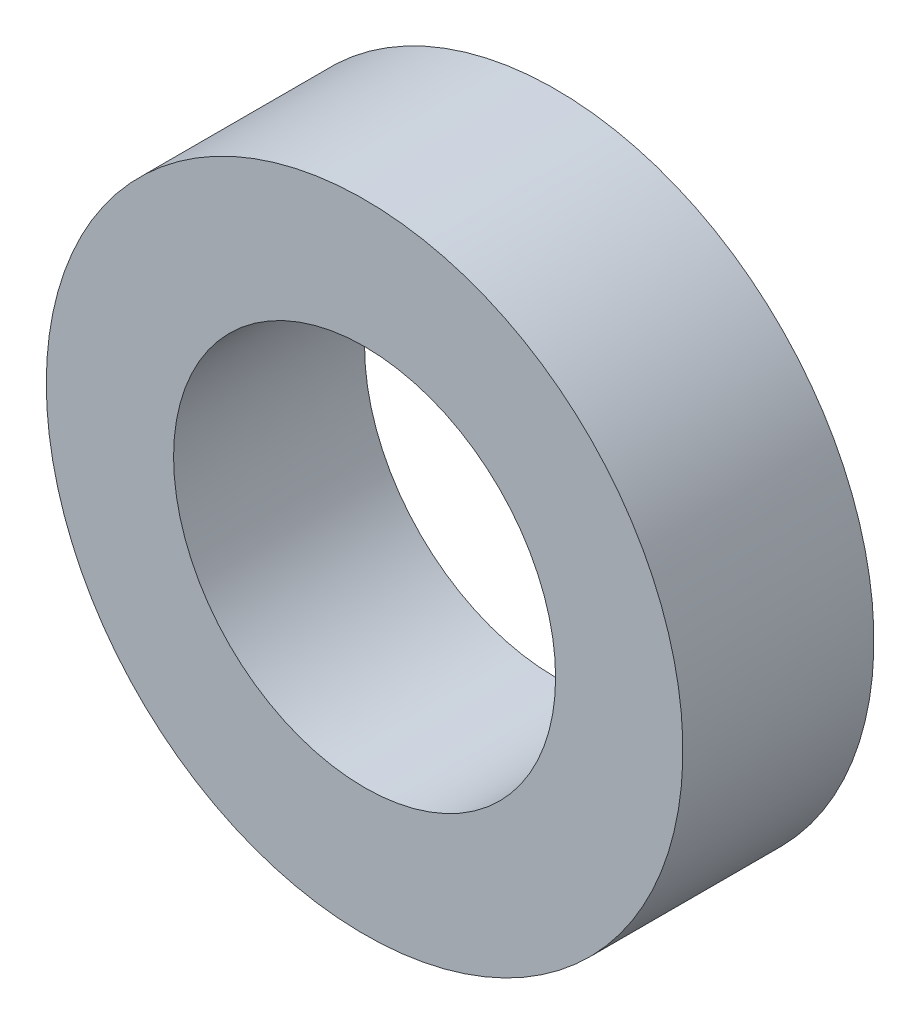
ISO-10303-21;
HEADER;
FILE_DESCRIPTION(('STEP AP214'),'2;1');
FILE_NAME('part.step','',(''),(''),'','','');
FILE_SCHEMA(('AUTOMOTIVE_DESIGN { 1 0 10303 214 1 1 1 1 }'));
ENDSEC;
DATA;
#1=APPLICATION_CONTEXT('core data for automotive mechanical design processes');
#2=APPLICATION_PROTOCOL_DEFINITION('international standard','automotive_design',2000,#1);
#3=PRODUCT_CONTEXT('',#1,'mechanical');
#4=PRODUCT('Part','Part','',(#3));
#5=PRODUCT_RELATED_PRODUCT_CATEGORY('part','',(#4));
#6=PRODUCT_DEFINITION_FORMATION('','',#4);
#7=PRODUCT_DEFINITION_CONTEXT('part definition',#1,'design');
#8=PRODUCT_DEFINITION('design','',#6,#7);
#9=PRODUCT_DEFINITION_SHAPE('','',#8);
#10=(LENGTH_UNIT() NAMED_UNIT(*) SI_UNIT(.MILLI.,.METRE.));
#11=(NAMED_UNIT(*) PLANE_ANGLE_UNIT() SI_UNIT($,.RADIAN.));
#12=(NAMED_UNIT(*) SI_UNIT($,.STERADIAN.) SOLID_ANGLE_UNIT());
#13=UNCERTAINTY_MEASURE_WITH_UNIT(LENGTH_MEASURE(1.E-05),#10,'distance_accuracy_value','');
#14=(GEOMETRIC_REPRESENTATION_CONTEXT(3) GLOBAL_UNCERTAINTY_ASSIGNED_CONTEXT((#13)) GLOBAL_UNIT_ASSIGNED_CONTEXT((#10,
#11,#12)) REPRESENTATION_CONTEXT('',''));
#15=CARTESIAN_POINT('',(0.,0.,0.));
#16=DIRECTION('',(0.,0.,1.));
#17=DIRECTION('',(1.,0.,0.));
#18=AXIS2_PLACEMENT_3D('',#15,#16,#17);
#19=CARTESIAN_POINT('',(0.,0.,2.99973999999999));
#20=DIRECTION('',(0.,0.,0.999999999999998));
#21=DIRECTION('',(0.999999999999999,0.,0.));
#22=AXIS2_PLACEMENT_3D('',#19,#20,#21);
#23=PLANE('',#22);
#24=CARTESIAN_POINT('',(0.,0.,2.99973999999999));
#25=DIRECTION('',(0.,0.,0.999999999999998));
#26=DIRECTION('',(0.999999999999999,0.,0.));
#27=AXIS2_PLACEMENT_3D('',#24,#25,#26);
#28=CIRCLE('',#27,4.99872);
#29=CARTESIAN_POINT('',(-4.99872,0.,2.99973999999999));
#30=VERTEX_POINT('',#29);
#31=EDGE_CURVE('E10',#30,#30,#28,.T.);
#32=ORIENTED_EDGE('',*,*,#31,.T.);
#33=EDGE_LOOP('',(#32));
#34=FACE_BOUND('',#33,.T.);
#35=CARTESIAN_POINT('',(0.,0.,2.99973999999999));
#36=DIRECTION('',(0.,0.,0.999999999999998));
#37=DIRECTION('',(0.999999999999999,0.,0.));
#38=AXIS2_PLACEMENT_3D('',#35,#36,#37);
#39=CIRCLE('',#38,2.99974);
#40=CARTESIAN_POINT('',(-2.99974,0.,2.99973999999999));
#41=VERTEX_POINT('',#40);
#42=EDGE_CURVE('E41',#41,#41,#39,.T.);
#43=ORIENTED_EDGE('',*,*,#42,.F.);
#44=EDGE_LOOP('',(#43));
#45=FACE_BOUND('',#44,.T.);
#46=ADVANCED_FACE('F30',(#34,#45),#23,.T.);
#47=CARTESIAN_POINT('',(0.,0.,0.));
#48=DIRECTION('',(0.,0.,0.999999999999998));
#49=DIRECTION('',(0.999999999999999,0.,0.));
#50=AXIS2_PLACEMENT_3D('',#47,#48,#49);
#51=PLANE('',#50);
#52=CARTESIAN_POINT('',(0.,0.,0.));
#53=DIRECTION('',(0.,0.,0.999999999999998));
#54=DIRECTION('',(0.999999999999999,0.,0.));
#55=AXIS2_PLACEMENT_3D('',#52,#53,#54);
#56=CIRCLE('',#55,4.99872);
#57=CARTESIAN_POINT('',(-4.99872,0.,0.));
#58=VERTEX_POINT('',#57);
#59=EDGE_CURVE('E34',#58,#58,#56,.T.);
#60=ORIENTED_EDGE('',*,*,#59,.F.);
#61=EDGE_LOOP('',(#60));
#62=FACE_BOUND('',#61,.T.);
#63=CARTESIAN_POINT('',(0.,0.,0.));
#64=DIRECTION('',(0.,0.,0.999999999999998));
#65=DIRECTION('',(0.999999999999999,0.,0.));
#66=AXIS2_PLACEMENT_3D('',#63,#64,#65);
#67=CIRCLE('',#66,2.99974);
#68=CARTESIAN_POINT('',(-2.99974,0.,0.));
#69=VERTEX_POINT('',#68);
#70=EDGE_CURVE('E43',#69,#69,#67,.T.);
#71=ORIENTED_EDGE('',*,*,#70,.T.);
#72=EDGE_LOOP('',(#71));
#73=FACE_BOUND('',#72,.T.);
#74=ADVANCED_FACE('F53',(#62,#73),#51,.F.);
#75=CARTESIAN_POINT('',(0.,0.,2.99973999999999));
#76=DIRECTION('',(0.,0.,-0.999999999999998));
#77=DIRECTION('',(-0.999999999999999,0.,0.));
#78=AXIS2_PLACEMENT_3D('',#75,#76,#77);
#79=CYLINDRICAL_SURFACE('',#78,4.99872);
#80=CARTESIAN_POINT('',(-4.99872,0.,2.99973999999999));
#81=CARTESIAN_POINT('',(-4.99872,0.,2.96849270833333));
#82=CARTESIAN_POINT('',(-4.99872,0.,2.93724541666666));
#83=CARTESIAN_POINT('',(-4.99872,0.,2.87475083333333));
#84=CARTESIAN_POINT('',(-4.99872,0.,2.84350354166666));
#85=CARTESIAN_POINT('',(-4.99872,0.,2.78100895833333));
#86=CARTESIAN_POINT('',(-4.99872,0.,2.74976166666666));
#87=CARTESIAN_POINT('',(-4.99872,0.,2.68726708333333));
#88=CARTESIAN_POINT('',(-4.99872,0.,2.65601979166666));
#89=CARTESIAN_POINT('',(-4.99872,0.,2.59352520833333));
#90=CARTESIAN_POINT('',(-4.99872,0.,2.56227791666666));
#91=CARTESIAN_POINT('',(-4.99872,0.,2.49978333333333));
#92=CARTESIAN_POINT('',(-4.99872,0.,2.46853604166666));
#93=CARTESIAN_POINT('',(-4.99872,0.,2.40604145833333));
#94=CARTESIAN_POINT('',(-4.99872,0.,2.37479416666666));
#95=CARTESIAN_POINT('',(-4.99872,0.,2.31229958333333));
#96=CARTESIAN_POINT('',(-4.99872,0.,2.28105229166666));
#97=CARTESIAN_POINT('',(-4.99872,0.,2.21855770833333));
#98=CARTESIAN_POINT('',(-4.99872,0.,2.18731041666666));
#99=CARTESIAN_POINT('',(-4.99872,0.,2.12481583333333));
#100=CARTESIAN_POINT('',(-4.99872,0.,2.09356854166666));
#101=CARTESIAN_POINT('',(-4.99872,0.,2.03107395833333));
#102=CARTESIAN_POINT('',(-4.99872,0.,1.99982666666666));
#103=CARTESIAN_POINT('',(-4.99872,0.,1.93733208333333));
#104=CARTESIAN_POINT('',(-4.99872,0.,1.90608479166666));
#105=CARTESIAN_POINT('',(-4.99872,0.,1.84359020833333));
#106=CARTESIAN_POINT('',(-4.99872,0.,1.81234291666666));
#107=CARTESIAN_POINT('',(-4.99872,0.,1.74984833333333));
#108=CARTESIAN_POINT('',(-4.99872,0.,1.71860104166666));
#109=CARTESIAN_POINT('',(-4.99872,0.,1.65610645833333));
#110=CARTESIAN_POINT('',(-4.99872,0.,1.62485916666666));
#111=CARTESIAN_POINT('',(-4.99872,0.,1.56236458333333));
#112=CARTESIAN_POINT('',(-4.99872,0.,1.53111729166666));
#113=CARTESIAN_POINT('',(-4.99872,0.,1.46862270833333));
#114=CARTESIAN_POINT('',(-4.99872,0.,1.43737541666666));
#115=CARTESIAN_POINT('',(-4.99872,0.,1.37488083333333));
#116=CARTESIAN_POINT('',(-4.99872,0.,1.34363354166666));
#117=CARTESIAN_POINT('',(-4.99872,0.,1.28113895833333));
#118=CARTESIAN_POINT('',(-4.99872,0.,1.24989166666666));
#119=CARTESIAN_POINT('',(-4.99872,0.,1.18739708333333));
#120=CARTESIAN_POINT('',(-4.99872,0.,1.15614979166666));
#121=CARTESIAN_POINT('',(-4.99872,0.,1.09365520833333));
#122=CARTESIAN_POINT('',(-4.99872,0.,1.06240791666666));
#123=CARTESIAN_POINT('',(-4.99872,0.,0.999913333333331));
#124=CARTESIAN_POINT('',(-4.99872,0.,0.968666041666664));
#125=CARTESIAN_POINT('',(-4.99872,0.,0.906171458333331));
#126=CARTESIAN_POINT('',(-4.99872,0.,0.874924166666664));
#127=CARTESIAN_POINT('',(-4.99872,0.,0.812429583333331));
#128=CARTESIAN_POINT('',(-4.99872,0.,0.781182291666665));
#129=CARTESIAN_POINT('',(-4.99872,0.,0.718687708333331));
#130=CARTESIAN_POINT('',(-4.99872,0.,0.687440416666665));
#131=CARTESIAN_POINT('',(-4.99872,0.,0.624945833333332));
#132=CARTESIAN_POINT('',(-4.99872,0.,0.593698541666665));
#133=CARTESIAN_POINT('',(-4.99872,0.,0.531203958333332));
#134=CARTESIAN_POINT('',(-4.99872,0.,0.499956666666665));
#135=CARTESIAN_POINT('',(-4.99872,0.,0.437462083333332));
#136=CARTESIAN_POINT('',(-4.99872,0.,0.406214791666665));
#137=CARTESIAN_POINT('',(-4.99872,0.,0.343720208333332));
#138=CARTESIAN_POINT('',(-4.99872,0.,0.312472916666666));
#139=CARTESIAN_POINT('',(-4.99872,0.,0.249978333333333));
#140=CARTESIAN_POINT('',(-4.99872,0.,0.218731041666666));
#141=CARTESIAN_POINT('',(-4.99872,0.,0.156236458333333));
#142=CARTESIAN_POINT('',(-4.99872,0.,0.124989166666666));
#143=CARTESIAN_POINT('',(-4.99872,0.,0.0624945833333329));
#144=CARTESIAN_POINT('',(-4.99872,0.,0.0312472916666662));
#145=CARTESIAN_POINT('',(-4.99872,0.,0.));
#146=B_SPLINE_CURVE_WITH_KNOTS('',3,(#80,#81,#82,#83,#84,#85,#86,#87,#88,#89,#90,#91,#92,#93,
#94,#95,#96,#97,#98,#99,#100,#101,#102,#103,#104,#105,#106,#107,#108,#109,#110,#111,#112,#113,
#114,#115,#116,#117,#118,#119,#120,#121,#122,#123,#124,#125,#126,#127,#128,#129,#130,#131,#132,
#133,#134,#135,#136,#137,#138,#139,#140,#141,#142,#143,#144,#145),.UNSPECIFIED.,.F.,.F.,(4,2,2,
2,2,2,2,2,2,2,2,2,2,2,2,2,2,2,2,2,2,2,2,2,2,2,2,2,2,2,2,2,4),(0.,0.0937418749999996,
0.187483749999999,0.281225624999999,0.374967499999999,0.468709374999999,0.562451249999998,
0.656193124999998,0.749934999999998,0.843676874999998,0.937418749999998,1.031160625,1.1249025,
1.218644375,1.31238625,1.406128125,1.49987,1.593611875,1.68735375,1.781095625,1.8748375,
1.968579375,2.06232125,2.15606312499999,2.24980499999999,2.34354687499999,2.43728874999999,
2.53103062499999,2.62477249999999,2.71851437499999,2.81225624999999,2.90599812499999,
2.99973999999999),.UNSPECIFIED.);
#147=EDGE_CURVE('BSEAM32',#30,#58,#146,.T.);
#148=ORIENTED_EDGE('',*,*,#31,.F.);
#149=ORIENTED_EDGE('',*,*,#59,.T.);
#150=ORIENTED_EDGE('',*,*,#147,.T.);
#151=ORIENTED_EDGE('',*,*,#147,.F.);
#152=EDGE_LOOP('',(#148,#150,#149,#151));
#153=FACE_BOUND('',#152,.T.);
#154=ADVANCED_FACE('F32',(#153),#79,.T.);
#155=CARTESIAN_POINT('',(0.,0.,2.99973999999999));
#156=DIRECTION('',(0.,0.,-0.999999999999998));
#157=DIRECTION('',(-0.999999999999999,0.,0.));
#158=AXIS2_PLACEMENT_3D('',#155,#156,#157);
#159=CYLINDRICAL_SURFACE('',#158,2.99974);
#160=CARTESIAN_POINT('',(-2.99974,0.,2.99973999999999));
#161=CARTESIAN_POINT('',(-2.99974,0.,2.96849270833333));
#162=CARTESIAN_POINT('',(-2.99974,0.,2.93724541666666));
#163=CARTESIAN_POINT('',(-2.99974,0.,2.87475083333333));
#164=CARTESIAN_POINT('',(-2.99974,0.,2.84350354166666));
#165=CARTESIAN_POINT('',(-2.99974,0.,2.78100895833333));
#166=CARTESIAN_POINT('',(-2.99974,0.,2.74976166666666));
#167=CARTESIAN_POINT('',(-2.99974,0.,2.68726708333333));
#168=CARTESIAN_POINT('',(-2.99974,0.,2.65601979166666));
#169=CARTESIAN_POINT('',(-2.99974,0.,2.59352520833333));
#170=CARTESIAN_POINT('',(-2.99974,0.,2.56227791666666));
#171=CARTESIAN_POINT('',(-2.99974,0.,2.49978333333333));
#172=CARTESIAN_POINT('',(-2.99974,0.,2.46853604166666));
#173=CARTESIAN_POINT('',(-2.99974,0.,2.40604145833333));
#174=CARTESIAN_POINT('',(-2.99974,0.,2.37479416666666));
#175=CARTESIAN_POINT('',(-2.99974,0.,2.31229958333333));
#176=CARTESIAN_POINT('',(-2.99974,0.,2.28105229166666));
#177=CARTESIAN_POINT('',(-2.99974,0.,2.21855770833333));
#178=CARTESIAN_POINT('',(-2.99974,0.,2.18731041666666));
#179=CARTESIAN_POINT('',(-2.99974,0.,2.12481583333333));
#180=CARTESIAN_POINT('',(-2.99974,0.,2.09356854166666));
#181=CARTESIAN_POINT('',(-2.99974,0.,2.03107395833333));
#182=CARTESIAN_POINT('',(-2.99974,0.,1.99982666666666));
#183=CARTESIAN_POINT('',(-2.99974,0.,1.93733208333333));
#184=CARTESIAN_POINT('',(-2.99974,0.,1.90608479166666));
#185=CARTESIAN_POINT('',(-2.99974,0.,1.84359020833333));
#186=CARTESIAN_POINT('',(-2.99974,0.,1.81234291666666));
#187=CARTESIAN_POINT('',(-2.99974,0.,1.74984833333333));
#188=CARTESIAN_POINT('',(-2.99974,0.,1.71860104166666));
#189=CARTESIAN_POINT('',(-2.99974,0.,1.65610645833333));
#190=CARTESIAN_POINT('',(-2.99974,0.,1.62485916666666));
#191=CARTESIAN_POINT('',(-2.99974,0.,1.56236458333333));
#192=CARTESIAN_POINT('',(-2.99974,0.,1.53111729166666));
#193=CARTESIAN_POINT('',(-2.99974,0.,1.46862270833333));
#194=CARTESIAN_POINT('',(-2.99974,0.,1.43737541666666));
#195=CARTESIAN_POINT('',(-2.99974,0.,1.37488083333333));
#196=CARTESIAN_POINT('',(-2.99974,0.,1.34363354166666));
#197=CARTESIAN_POINT('',(-2.99974,0.,1.28113895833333));
#198=CARTESIAN_POINT('',(-2.99974,0.,1.24989166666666));
#199=CARTESIAN_POINT('',(-2.99974,0.,1.18739708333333));
#200=CARTESIAN_POINT('',(-2.99974,0.,1.15614979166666));
#201=CARTESIAN_POINT('',(-2.99974,0.,1.09365520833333));
#202=CARTESIAN_POINT('',(-2.99974,0.,1.06240791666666));
#203=CARTESIAN_POINT('',(-2.99974,0.,0.999913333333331));
#204=CARTESIAN_POINT('',(-2.99974,0.,0.968666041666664));
#205=CARTESIAN_POINT('',(-2.99974,0.,0.906171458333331));
#206=CARTESIAN_POINT('',(-2.99974,0.,0.874924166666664));
#207=CARTESIAN_POINT('',(-2.99974,0.,0.812429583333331));
#208=CARTESIAN_POINT('',(-2.99974,0.,0.781182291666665));
#209=CARTESIAN_POINT('',(-2.99974,0.,0.718687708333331));
#210=CARTESIAN_POINT('',(-2.99974,0.,0.687440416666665));
#211=CARTESIAN_POINT('',(-2.99974,0.,0.624945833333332));
#212=CARTESIAN_POINT('',(-2.99974,0.,0.593698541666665));
#213=CARTESIAN_POINT('',(-2.99974,0.,0.531203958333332));
#214=CARTESIAN_POINT('',(-2.99974,0.,0.499956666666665));
#215=CARTESIAN_POINT('',(-2.99974,0.,0.437462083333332));
#216=CARTESIAN_POINT('',(-2.99974,0.,0.406214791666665));
#217=CARTESIAN_POINT('',(-2.99974,0.,0.343720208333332));
#218=CARTESIAN_POINT('',(-2.99974,0.,0.312472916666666));
#219=CARTESIAN_POINT('',(-2.99974,0.,0.249978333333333));
#220=CARTESIAN_POINT('',(-2.99974,0.,0.218731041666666));
#221=CARTESIAN_POINT('',(-2.99974,0.,0.156236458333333));
#222=CARTESIAN_POINT('',(-2.99974,0.,0.124989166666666));
#223=CARTESIAN_POINT('',(-2.99974,0.,0.0624945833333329));
#224=CARTESIAN_POINT('',(-2.99974,0.,0.0312472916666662));
#225=CARTESIAN_POINT('',(-2.99974,0.,0.));
#226=B_SPLINE_CURVE_WITH_KNOTS('',3,(#160,#161,#162,#163,#164,#165,#166,#167,#168,#169,#170,
#171,#172,#173,#174,#175,#176,#177,#178,#179,#180,#181,#182,#183,#184,#185,#186,#187,#188,#189,
#190,#191,#192,#193,#194,#195,#196,#197,#198,#199,#200,#201,#202,#203,#204,#205,#206,#207,#208,
#209,#210,#211,#212,#213,#214,#215,#216,#217,#218,#219,#220,#221,#222,#223,#224,#225),
.UNSPECIFIED.,.F.,.F.,(4,2,2,2,2,2,2,2,2,2,2,2,2,2,2,2,2,2,2,2,2,2,2,2,2,2,2,2,2,2,2,2,4),(0.,
0.093741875,0.18748375,0.281225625,0.374967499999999,0.468709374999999,0.562451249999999,
0.656193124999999,0.749934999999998,0.843676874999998,0.937418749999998,1.031160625,1.1249025,
1.218644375,1.31238625,1.406128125,1.49987,1.593611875,1.68735375,1.781095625,1.8748375,
1.968579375,2.06232125,2.156063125,2.24980499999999,2.343546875,2.43728874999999,
2.53103062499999,2.62477249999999,2.71851437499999,2.81225624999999,2.90599812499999,
2.99973999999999),.UNSPECIFIED.);
#227=EDGE_CURVE('BSEAM49',#41,#69,#226,.T.);
#228=ORIENTED_EDGE('',*,*,#42,.T.);
#229=ORIENTED_EDGE('',*,*,#70,.F.);
#230=ORIENTED_EDGE('',*,*,#227,.T.);
#231=ORIENTED_EDGE('',*,*,#227,.F.);
#232=EDGE_LOOP('',(#228,#230,#229,#231));
#233=FACE_BOUND('',#232,.T.);
#234=ADVANCED_FACE('F49',(#233),#159,.F.);
#235=CLOSED_SHELL('',(#46,#74,#154,#234));
#236=MANIFOLD_SOLID_BREP('B2',#235);
#237=ADVANCED_BREP_SHAPE_REPRESENTATION('',(#18,#236),#14);
#238=SHAPE_DEFINITION_REPRESENTATION(#9,#237);
ENDSEC;
END-ISO-10303-21;
